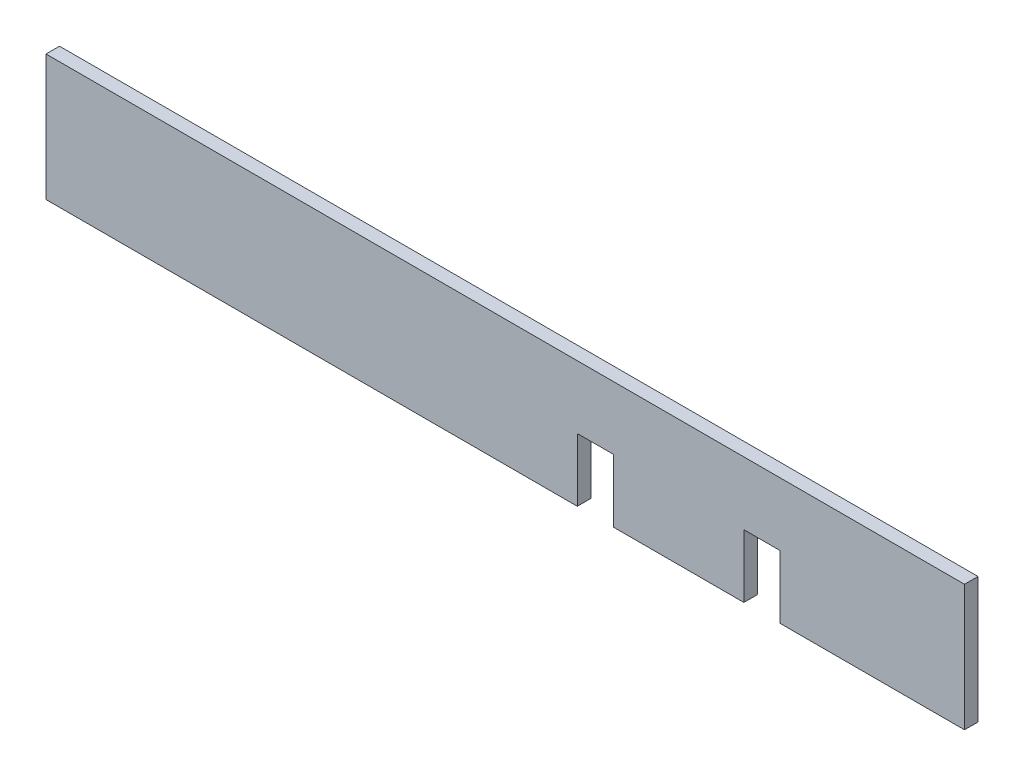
ISO-10303-21;
HEADER;
FILE_DESCRIPTION(('STEP AP214'),'2;1');
FILE_NAME('part.step','',(''),(''),'','','');
FILE_SCHEMA(('AUTOMOTIVE_DESIGN { 1 0 10303 214 1 1 1 1 }'));
ENDSEC;
DATA;
#1=APPLICATION_CONTEXT('core data for automotive mechanical design processes');
#2=APPLICATION_PROTOCOL_DEFINITION('international standard','automotive_design',2000,#1);
#3=PRODUCT_CONTEXT('',#1,'mechanical');
#4=PRODUCT('Part','Part','',(#3));
#5=PRODUCT_RELATED_PRODUCT_CATEGORY('part','',(#4));
#6=PRODUCT_DEFINITION_FORMATION('','',#4);
#7=PRODUCT_DEFINITION_CONTEXT('part definition',#1,'design');
#8=PRODUCT_DEFINITION('design','',#6,#7);
#9=PRODUCT_DEFINITION_SHAPE('','',#8);
#10=(LENGTH_UNIT() NAMED_UNIT(*) SI_UNIT(.MILLI.,.METRE.));
#11=(NAMED_UNIT(*) PLANE_ANGLE_UNIT() SI_UNIT($,.RADIAN.));
#12=(NAMED_UNIT(*) SI_UNIT($,.STERADIAN.) SOLID_ANGLE_UNIT());
#13=UNCERTAINTY_MEASURE_WITH_UNIT(LENGTH_MEASURE(1.E-05),#10,'distance_accuracy_value','');
#14=(GEOMETRIC_REPRESENTATION_CONTEXT(3) GLOBAL_UNCERTAINTY_ASSIGNED_CONTEXT((#13)) GLOBAL_UNIT_ASSIGNED_CONTEXT((#10,
#11,#12)) REPRESENTATION_CONTEXT('',''));
#15=CARTESIAN_POINT('',(0.,0.,0.));
#16=DIRECTION('',(0.,0.,1.));
#17=DIRECTION('',(1.,0.,0.));
#18=AXIS2_PLACEMENT_3D('',#15,#16,#17);
#19=CARTESIAN_POINT('',(590.,0.,15.));
#20=DIRECTION('',(0.,1.,0.));
#21=DIRECTION('',(-1.,0.,0.));
#22=AXIS2_PLACEMENT_3D('',#19,#20,#21);
#23=PLANE('',#22);
#24=DIRECTION('',(1.,0.,0.));
#25=VECTOR('',#24,1.);
#26=CARTESIAN_POINT('',(590.,0.,0.));
#27=LINE('',#26,#25);
#28=CARTESIAN_POINT('',(0.,0.,0.));
#29=VERTEX_POINT('',#28);
#30=CARTESIAN_POINT('',(590.,0.,0.));
#31=VERTEX_POINT('',#30);
#32=EDGE_CURVE('E122',#29,#31,#27,.T.);
#33=ORIENTED_EDGE('',*,*,#32,.T.);
#34=DIRECTION('',(0.,0.,-1.));
#35=VECTOR('',#34,1.);
#36=CARTESIAN_POINT('',(590.,0.,15.));
#37=LINE('',#36,#35);
#38=CARTESIAN_POINT('',(590.,0.,15.));
#39=VERTEX_POINT('',#38);
#40=EDGE_CURVE('E11',#39,#31,#37,.T.);
#41=ORIENTED_EDGE('',*,*,#40,.F.);
#42=DIRECTION('',(1.,0.,0.));
#43=VECTOR('',#42,1.);
#44=CARTESIAN_POINT('',(590.,0.,15.));
#45=LINE('',#44,#43);
#46=CARTESIAN_POINT('',(0.,0.,15.));
#47=VERTEX_POINT('',#46);
#48=EDGE_CURVE('E157',#47,#39,#45,.T.);
#49=ORIENTED_EDGE('',*,*,#48,.F.);
#50=DIRECTION('',(0.,0.,-1.));
#51=VECTOR('',#50,1.);
#52=CARTESIAN_POINT('',(0.,0.,15.));
#53=LINE('',#52,#51);
#54=EDGE_CURVE('E135',#47,#29,#53,.T.);
#55=ORIENTED_EDGE('',*,*,#54,.T.);
#56=EDGE_LOOP('',(#33,#41,#49,#55));
#57=FACE_BOUND('',#56,.T.);
#58=ADVANCED_FACE('F30',(#57),#23,.F.);
#59=CARTESIAN_POINT('',(590.,70.,15.));
#60=DIRECTION('',(-1.,0.,0.));
#61=DIRECTION('',(0.,-1.,0.));
#62=AXIS2_PLACEMENT_3D('',#59,#60,#61);
#63=PLANE('',#62);
#64=DIRECTION('',(0.,1.,0.));
#65=VECTOR('',#64,1.);
#66=CARTESIAN_POINT('',(590.,70.,0.));
#67=LINE('',#66,#65);
#68=CARTESIAN_POINT('',(590.,70.,0.));
#69=VERTEX_POINT('',#68);
#70=EDGE_CURVE('E118',#31,#69,#67,.T.);
#71=ORIENTED_EDGE('',*,*,#70,.T.);
#72=DIRECTION('',(0.,0.,-1.));
#73=VECTOR('',#72,1.);
#74=CARTESIAN_POINT('',(590.,70.,15.));
#75=LINE('',#74,#73);
#76=CARTESIAN_POINT('',(590.,70.,15.));
#77=VERTEX_POINT('',#76);
#78=EDGE_CURVE('E37',#77,#69,#75,.T.);
#79=ORIENTED_EDGE('',*,*,#78,.F.);
#80=DIRECTION('',(0.,1.,0.));
#81=VECTOR('',#80,1.);
#82=CARTESIAN_POINT('',(590.,70.,15.));
#83=LINE('',#82,#81);
#84=EDGE_CURVE('E131',#39,#77,#83,.T.);
#85=ORIENTED_EDGE('',*,*,#84,.F.);
#86=ORIENTED_EDGE('',*,*,#40,.T.);
#87=EDGE_LOOP('',(#71,#79,#85,#86));
#88=FACE_BOUND('',#87,.T.);
#89=ADVANCED_FACE('F130',(#88),#63,.F.);
#90=CARTESIAN_POINT('',(630.,70.,15.));
#91=DIRECTION('',(0.,1.,0.));
#92=DIRECTION('',(-1.,0.,0.));
#93=AXIS2_PLACEMENT_3D('',#90,#91,#92);
#94=PLANE('',#93);
#95=DIRECTION('',(1.,0.,0.));
#96=VECTOR('',#95,1.);
#97=CARTESIAN_POINT('',(630.,70.,0.));
#98=LINE('',#97,#96);
#99=CARTESIAN_POINT('',(630.,70.,0.));
#100=VERTEX_POINT('',#99);
#101=EDGE_CURVE('E124',#69,#100,#98,.T.);
#102=ORIENTED_EDGE('',*,*,#101,.T.);
#103=DIRECTION('',(0.,0.,-1.));
#104=VECTOR('',#103,1.);
#105=CARTESIAN_POINT('',(630.,70.,15.));
#106=LINE('',#105,#104);
#107=CARTESIAN_POINT('',(630.,70.,15.));
#108=VERTEX_POINT('',#107);
#109=EDGE_CURVE('E203',#108,#100,#106,.T.);
#110=ORIENTED_EDGE('',*,*,#109,.F.);
#111=DIRECTION('',(1.,0.,0.));
#112=VECTOR('',#111,1.);
#113=CARTESIAN_POINT('',(630.,70.,15.));
#114=LINE('',#113,#112);
#115=EDGE_CURVE('E160',#77,#108,#114,.T.);
#116=ORIENTED_EDGE('',*,*,#115,.F.);
#117=ORIENTED_EDGE('',*,*,#78,.T.);
#118=EDGE_LOOP('',(#102,#110,#116,#117));
#119=FACE_BOUND('',#118,.T.);
#120=ADVANCED_FACE('F207',(#119),#94,.F.);
#121=CARTESIAN_POINT('',(630.,0.,15.));
#122=DIRECTION('',(1.,0.,0.));
#123=DIRECTION('',(0.,0.,-1.));
#124=AXIS2_PLACEMENT_3D('',#121,#122,#123);
#125=PLANE('',#124);
#126=DIRECTION('',(0.,-1.,0.));
#127=VECTOR('',#126,1.);
#128=CARTESIAN_POINT('',(630.,0.,0.));
#129=LINE('',#128,#127);
#130=CARTESIAN_POINT('',(630.,0.,0.));
#131=VERTEX_POINT('',#130);
#132=EDGE_CURVE('E139',#100,#131,#129,.T.);
#133=ORIENTED_EDGE('',*,*,#132,.T.);
#134=DIRECTION('',(0.,0.,-1.));
#135=VECTOR('',#134,1.);
#136=CARTESIAN_POINT('',(630.,0.,15.));
#137=LINE('',#136,#135);
#138=CARTESIAN_POINT('',(630.,0.,15.));
#139=VERTEX_POINT('',#138);
#140=EDGE_CURVE('E200',#139,#131,#137,.T.);
#141=ORIENTED_EDGE('',*,*,#140,.F.);
#142=DIRECTION('',(0.,-1.,0.));
#143=VECTOR('',#142,1.);
#144=CARTESIAN_POINT('',(630.,0.,15.));
#145=LINE('',#144,#143);
#146=EDGE_CURVE('E162',#108,#139,#145,.T.);
#147=ORIENTED_EDGE('',*,*,#146,.F.);
#148=ORIENTED_EDGE('',*,*,#109,.T.);
#149=EDGE_LOOP('',(#133,#141,#147,#148));
#150=FACE_BOUND('',#149,.T.);
#151=ADVANCED_FACE('F215',(#150),#125,.F.);
#152=CARTESIAN_POINT('',(775.,0.,15.));
#153=DIRECTION('',(0.,1.,0.));
#154=DIRECTION('',(-1.,0.,0.));
#155=AXIS2_PLACEMENT_3D('',#152,#153,#154);
#156=PLANE('',#155);
#157=DIRECTION('',(1.,0.,0.));
#158=VECTOR('',#157,1.);
#159=CARTESIAN_POINT('',(775.,0.,0.));
#160=LINE('',#159,#158);
#161=CARTESIAN_POINT('',(775.,0.,0.));
#162=VERTEX_POINT('',#161);
#163=EDGE_CURVE('E141',#131,#162,#160,.T.);
#164=ORIENTED_EDGE('',*,*,#163,.T.);
#165=DIRECTION('',(0.,0.,-1.));
#166=VECTOR('',#165,1.);
#167=CARTESIAN_POINT('',(775.,0.,15.));
#168=LINE('',#167,#166);
#169=CARTESIAN_POINT('',(775.,0.,15.));
#170=VERTEX_POINT('',#169);
#171=EDGE_CURVE('E197',#170,#162,#168,.T.);
#172=ORIENTED_EDGE('',*,*,#171,.F.);
#173=DIRECTION('',(1.,0.,0.));
#174=VECTOR('',#173,1.);
#175=CARTESIAN_POINT('',(775.,0.,15.));
#176=LINE('',#175,#174);
#177=EDGE_CURVE('E164',#139,#170,#176,.T.);
#178=ORIENTED_EDGE('',*,*,#177,.F.);
#179=ORIENTED_EDGE('',*,*,#140,.T.);
#180=EDGE_LOOP('',(#164,#172,#178,#179));
#181=FACE_BOUND('',#180,.T.);
#182=ADVANCED_FACE('F218',(#181),#156,.F.);
#183=CARTESIAN_POINT('',(775.,70.0000000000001,15.));
#184=DIRECTION('',(-1.,0.,0.));
#185=DIRECTION('',(0.,0.,1.));
#186=AXIS2_PLACEMENT_3D('',#183,#184,#185);
#187=PLANE('',#186);
#188=DIRECTION('',(0.,1.,0.));
#189=VECTOR('',#188,1.);
#190=CARTESIAN_POINT('',(775.,70.0000000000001,0.));
#191=LINE('',#190,#189);
#192=CARTESIAN_POINT('',(775.,70.0000000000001,0.));
#193=VERTEX_POINT('',#192);
#194=EDGE_CURVE('E143',#162,#193,#191,.T.);
#195=ORIENTED_EDGE('',*,*,#194,.T.);
#196=DIRECTION('',(0.,0.,-1.));
#197=VECTOR('',#196,1.);
#198=CARTESIAN_POINT('',(775.,70.0000000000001,15.));
#199=LINE('',#198,#197);
#200=CARTESIAN_POINT('',(775.,70.0000000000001,15.));
#201=VERTEX_POINT('',#200);
#202=EDGE_CURVE('E194',#201,#193,#199,.T.);
#203=ORIENTED_EDGE('',*,*,#202,.F.);
#204=DIRECTION('',(0.,1.,0.));
#205=VECTOR('',#204,1.);
#206=CARTESIAN_POINT('',(775.,70.0000000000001,15.));
#207=LINE('',#206,#205);
#208=EDGE_CURVE('E166',#170,#201,#207,.T.);
#209=ORIENTED_EDGE('',*,*,#208,.F.);
#210=ORIENTED_EDGE('',*,*,#171,.T.);
#211=EDGE_LOOP('',(#195,#203,#209,#210));
#212=FACE_BOUND('',#211,.T.);
#213=ADVANCED_FACE('F223',(#212),#187,.F.);
#214=CARTESIAN_POINT('',(815.,70.0000000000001,15.));
#215=DIRECTION('',(0.,1.,0.));
#216=DIRECTION('',(-1.,0.,0.));
#217=AXIS2_PLACEMENT_3D('',#214,#215,#216);
#218=PLANE('',#217);
#219=DIRECTION('',(1.,0.,0.));
#220=VECTOR('',#219,1.);
#221=CARTESIAN_POINT('',(815.,70.0000000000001,0.));
#222=LINE('',#221,#220);
#223=CARTESIAN_POINT('',(815.,70.0000000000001,0.));
#224=VERTEX_POINT('',#223);
#225=EDGE_CURVE('E145',#193,#224,#222,.T.);
#226=ORIENTED_EDGE('',*,*,#225,.T.);
#227=DIRECTION('',(0.,0.,-1.));
#228=VECTOR('',#227,1.);
#229=CARTESIAN_POINT('',(815.,70.0000000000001,15.));
#230=LINE('',#229,#228);
#231=CARTESIAN_POINT('',(815.,70.0000000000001,15.));
#232=VERTEX_POINT('',#231);
#233=EDGE_CURVE('E191',#232,#224,#230,.T.);
#234=ORIENTED_EDGE('',*,*,#233,.F.);
#235=DIRECTION('',(1.,0.,0.));
#236=VECTOR('',#235,1.);
#237=CARTESIAN_POINT('',(815.,70.0000000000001,15.));
#238=LINE('',#237,#236);
#239=EDGE_CURVE('E168',#201,#232,#238,.T.);
#240=ORIENTED_EDGE('',*,*,#239,.F.);
#241=ORIENTED_EDGE('',*,*,#202,.T.);
#242=EDGE_LOOP('',(#226,#234,#240,#241));
#243=FACE_BOUND('',#242,.T.);
#244=ADVANCED_FACE('F229',(#243),#218,.F.);
#245=CARTESIAN_POINT('',(815.,0.,15.));
#246=DIRECTION('',(1.,0.,0.));
#247=DIRECTION('',(0.,0.,-1.));
#248=AXIS2_PLACEMENT_3D('',#245,#246,#247);
#249=PLANE('',#248);
#250=DIRECTION('',(0.,-1.,0.));
#251=VECTOR('',#250,1.);
#252=CARTESIAN_POINT('',(815.,0.,0.));
#253=LINE('',#252,#251);
#254=CARTESIAN_POINT('',(815.,0.,0.));
#255=VERTEX_POINT('',#254);
#256=EDGE_CURVE('E147',#224,#255,#253,.T.);
#257=ORIENTED_EDGE('',*,*,#256,.T.);
#258=DIRECTION('',(0.,0.,-1.));
#259=VECTOR('',#258,1.);
#260=CARTESIAN_POINT('',(815.,0.,15.));
#261=LINE('',#260,#259);
#262=CARTESIAN_POINT('',(815.,0.,15.));
#263=VERTEX_POINT('',#262);
#264=EDGE_CURVE('E188',#263,#255,#261,.T.);
#265=ORIENTED_EDGE('',*,*,#264,.F.);
#266=DIRECTION('',(0.,-1.,0.));
#267=VECTOR('',#266,1.);
#268=CARTESIAN_POINT('',(815.,0.,15.));
#269=LINE('',#268,#267);
#270=EDGE_CURVE('E170',#232,#263,#269,.T.);
#271=ORIENTED_EDGE('',*,*,#270,.F.);
#272=ORIENTED_EDGE('',*,*,#233,.T.);
#273=EDGE_LOOP('',(#257,#265,#271,#272));
#274=FACE_BOUND('',#273,.T.);
#275=ADVANCED_FACE('F233',(#274),#249,.F.);
#276=CARTESIAN_POINT('',(1020.,0.,15.));
#277=DIRECTION('',(0.,1.,0.));
#278=DIRECTION('',(-1.,0.,0.));
#279=AXIS2_PLACEMENT_3D('',#276,#277,#278);
#280=PLANE('',#279);
#281=DIRECTION('',(1.,0.,0.));
#282=VECTOR('',#281,1.);
#283=CARTESIAN_POINT('',(1020.,0.,0.));
#284=LINE('',#283,#282);
#285=CARTESIAN_POINT('',(1020.,0.,0.));
#286=VERTEX_POINT('',#285);
#287=EDGE_CURVE('E149',#255,#286,#284,.T.);
#288=ORIENTED_EDGE('',*,*,#287,.T.);
#289=DIRECTION('',(0.,0.,-1.));
#290=VECTOR('',#289,1.);
#291=CARTESIAN_POINT('',(1020.,0.,15.));
#292=LINE('',#291,#290);
#293=CARTESIAN_POINT('',(1020.,0.,15.));
#294=VERTEX_POINT('',#293);
#295=EDGE_CURVE('E185',#294,#286,#292,.T.);
#296=ORIENTED_EDGE('',*,*,#295,.F.);
#297=DIRECTION('',(1.,0.,0.));
#298=VECTOR('',#297,1.);
#299=CARTESIAN_POINT('',(1020.,0.,15.));
#300=LINE('',#299,#298);
#301=EDGE_CURVE('E172',#263,#294,#300,.T.);
#302=ORIENTED_EDGE('',*,*,#301,.F.);
#303=ORIENTED_EDGE('',*,*,#264,.T.);
#304=EDGE_LOOP('',(#288,#296,#302,#303));
#305=FACE_BOUND('',#304,.T.);
#306=ADVANCED_FACE('F238',(#305),#280,.F.);
#307=CARTESIAN_POINT('',(1020.,140.,15.));
#308=DIRECTION('',(-1.,0.,0.));
#309=DIRECTION('',(0.,0.,1.));
#310=AXIS2_PLACEMENT_3D('',#307,#308,#309);
#311=PLANE('',#310);
#312=DIRECTION('',(0.,1.,0.));
#313=VECTOR('',#312,1.);
#314=CARTESIAN_POINT('',(1020.,140.,0.));
#315=LINE('',#314,#313);
#316=CARTESIAN_POINT('',(1020.,140.,0.));
#317=VERTEX_POINT('',#316);
#318=EDGE_CURVE('E151',#286,#317,#315,.T.);
#319=ORIENTED_EDGE('',*,*,#318,.T.);
#320=DIRECTION('',(0.,0.,-1.));
#321=VECTOR('',#320,1.);
#322=CARTESIAN_POINT('',(1020.,140.,15.));
#323=LINE('',#322,#321);
#324=CARTESIAN_POINT('',(1020.,140.,15.));
#325=VERTEX_POINT('',#324);
#326=EDGE_CURVE('E182',#325,#317,#323,.T.);
#327=ORIENTED_EDGE('',*,*,#326,.F.);
#328=DIRECTION('',(0.,1.,0.));
#329=VECTOR('',#328,1.);
#330=CARTESIAN_POINT('',(1020.,140.,15.));
#331=LINE('',#330,#329);
#332=EDGE_CURVE('E174',#294,#325,#331,.T.);
#333=ORIENTED_EDGE('',*,*,#332,.F.);
#334=ORIENTED_EDGE('',*,*,#295,.T.);
#335=EDGE_LOOP('',(#319,#327,#333,#334));
#336=FACE_BOUND('',#335,.T.);
#337=ADVANCED_FACE('F242',(#336),#311,.F.);
#338=CARTESIAN_POINT('',(0.,140.,15.));
#339=DIRECTION('',(0.,-1.,0.));
#340=DIRECTION('',(0.,0.,-1.));
#341=AXIS2_PLACEMENT_3D('',#338,#339,#340);
#342=PLANE('',#341);
#343=DIRECTION('',(-1.,0.,0.));
#344=VECTOR('',#343,1.);
#345=CARTESIAN_POINT('',(0.,140.,0.));
#346=LINE('',#345,#344);
#347=CARTESIAN_POINT('',(0.,140.,0.));
#348=VERTEX_POINT('',#347);
#349=EDGE_CURVE('E153',#317,#348,#346,.T.);
#350=ORIENTED_EDGE('',*,*,#349,.T.);
#351=DIRECTION('',(0.,0.,-1.));
#352=VECTOR('',#351,1.);
#353=CARTESIAN_POINT('',(0.,140.,15.));
#354=LINE('',#353,#352);
#355=CARTESIAN_POINT('',(0.,140.,15.));
#356=VERTEX_POINT('',#355);
#357=EDGE_CURVE('E179',#356,#348,#354,.T.);
#358=ORIENTED_EDGE('',*,*,#357,.F.);
#359=DIRECTION('',(-1.,0.,0.));
#360=VECTOR('',#359,1.);
#361=CARTESIAN_POINT('',(0.,140.,15.));
#362=LINE('',#361,#360);
#363=EDGE_CURVE('E49',#325,#356,#362,.T.);
#364=ORIENTED_EDGE('',*,*,#363,.F.);
#365=ORIENTED_EDGE('',*,*,#326,.T.);
#366=EDGE_LOOP('',(#350,#358,#364,#365));
#367=FACE_BOUND('',#366,.T.);
#368=ADVANCED_FACE('F246',(#367),#342,.F.);
#369=CARTESIAN_POINT('',(0.,0.,15.));
#370=DIRECTION('',(1.,0.,0.));
#371=DIRECTION('',(0.,0.,-1.));
#372=AXIS2_PLACEMENT_3D('',#369,#370,#371);
#373=PLANE('',#372);
#374=DIRECTION('',(0.,-1.,0.));
#375=VECTOR('',#374,1.);
#376=CARTESIAN_POINT('',(0.,0.,0.));
#377=LINE('',#376,#375);
#378=EDGE_CURVE('E155',#348,#29,#377,.T.);
#379=ORIENTED_EDGE('',*,*,#378,.T.);
#380=ORIENTED_EDGE('',*,*,#54,.F.);
#381=DIRECTION('',(0.,-1.,0.));
#382=VECTOR('',#381,1.);
#383=CARTESIAN_POINT('',(0.,0.,15.));
#384=LINE('',#383,#382);
#385=EDGE_CURVE('E44',#356,#47,#384,.T.);
#386=ORIENTED_EDGE('',*,*,#385,.F.);
#387=ORIENTED_EDGE('',*,*,#357,.T.);
#388=EDGE_LOOP('',(#379,#380,#386,#387));
#389=FACE_BOUND('',#388,.T.);
#390=ADVANCED_FACE('F248',(#389),#373,.F.);
#391=CARTESIAN_POINT('',(0.,0.,15.));
#392=DIRECTION('',(0.,0.,-1.));
#393=DIRECTION('',(-1.,0.,0.));
#394=AXIS2_PLACEMENT_3D('',#391,#392,#393);
#395=PLANE('',#394);
#396=ORIENTED_EDGE('',*,*,#48,.T.);
#397=ORIENTED_EDGE('',*,*,#84,.T.);
#398=ORIENTED_EDGE('',*,*,#115,.T.);
#399=ORIENTED_EDGE('',*,*,#146,.T.);
#400=ORIENTED_EDGE('',*,*,#177,.T.);
#401=ORIENTED_EDGE('',*,*,#208,.T.);
#402=ORIENTED_EDGE('',*,*,#239,.T.);
#403=ORIENTED_EDGE('',*,*,#270,.T.);
#404=ORIENTED_EDGE('',*,*,#301,.T.);
#405=ORIENTED_EDGE('',*,*,#332,.T.);
#406=ORIENTED_EDGE('',*,*,#363,.T.);
#407=ORIENTED_EDGE('',*,*,#385,.T.);
#408=EDGE_LOOP('',(#396,#397,#398,#399,#400,#401,#402,#403,#404,#405,#406,#407));
#409=FACE_BOUND('',#408,.T.);
#410=ADVANCED_FACE('F210',(#409),#395,.F.);
#411=CARTESIAN_POINT('',(0.,0.,0.));
#412=DIRECTION('',(0.,0.,-1.));
#413=DIRECTION('',(-1.,0.,0.));
#414=AXIS2_PLACEMENT_3D('',#411,#412,#413);
#415=PLANE('',#414);
#416=ORIENTED_EDGE('',*,*,#32,.F.);
#417=ORIENTED_EDGE('',*,*,#378,.F.);
#418=ORIENTED_EDGE('',*,*,#349,.F.);
#419=ORIENTED_EDGE('',*,*,#318,.F.);
#420=ORIENTED_EDGE('',*,*,#287,.F.);
#421=ORIENTED_EDGE('',*,*,#256,.F.);
#422=ORIENTED_EDGE('',*,*,#225,.F.);
#423=ORIENTED_EDGE('',*,*,#194,.F.);
#424=ORIENTED_EDGE('',*,*,#163,.F.);
#425=ORIENTED_EDGE('',*,*,#132,.F.);
#426=ORIENTED_EDGE('',*,*,#101,.F.);
#427=ORIENTED_EDGE('',*,*,#70,.F.);
#428=EDGE_LOOP('',(#416,#417,#418,#419,#420,#421,#422,#423,#424,#425,#426,#427));
#429=FACE_BOUND('',#428,.T.);
#430=ADVANCED_FACE('F119',(#429),#415,.T.);
#431=CLOSED_SHELL('',(#58,#89,#120,#151,#182,#213,#244,#275,#306,#337,#368,#390,#410,#430));
#432=MANIFOLD_SOLID_BREP('B2',#431);
#433=ADVANCED_BREP_SHAPE_REPRESENTATION('',(#18,#432),#14);
#434=SHAPE_DEFINITION_REPRESENTATION(#9,#433);
ENDSEC;
END-ISO-10303-21;
